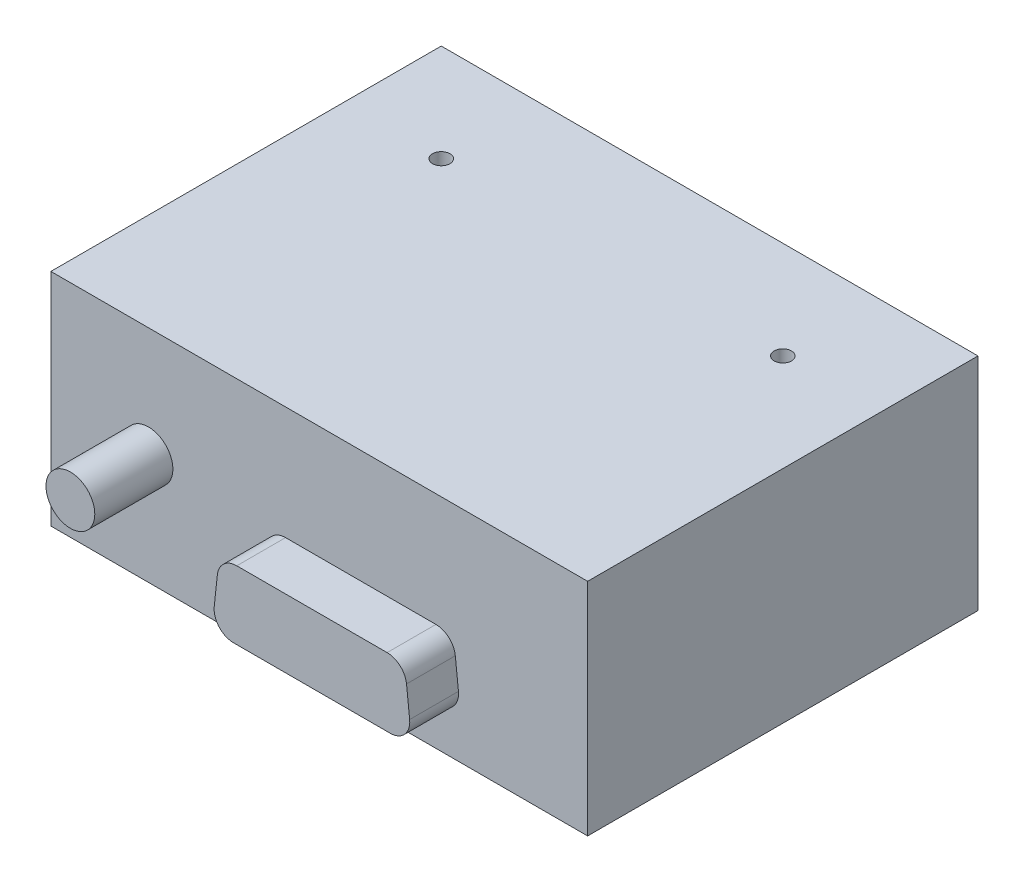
ISO-10303-21;
HEADER;
FILE_DESCRIPTION(('STEP AP214'),'2;1');
FILE_NAME('part.step','',(''),(''),'','','');
FILE_SCHEMA(('AUTOMOTIVE_DESIGN { 1 0 10303 214 1 1 1 1 }'));
ENDSEC;
DATA;
#1=APPLICATION_CONTEXT('core data for automotive mechanical design processes');
#2=APPLICATION_PROTOCOL_DEFINITION('international standard','automotive_design',2000,#1);
#3=PRODUCT_CONTEXT('',#1,'mechanical');
#4=PRODUCT('Part','Part','',(#3));
#5=PRODUCT_RELATED_PRODUCT_CATEGORY('part','',(#4));
#6=PRODUCT_DEFINITION_FORMATION('','',#4);
#7=PRODUCT_DEFINITION_CONTEXT('part definition',#1,'design');
#8=PRODUCT_DEFINITION('design','',#6,#7);
#9=PRODUCT_DEFINITION_SHAPE('','',#8);
#10=(LENGTH_UNIT() NAMED_UNIT(*) SI_UNIT(.MILLI.,.METRE.));
#11=(NAMED_UNIT(*) PLANE_ANGLE_UNIT() SI_UNIT($,.RADIAN.));
#12=(NAMED_UNIT(*) SI_UNIT($,.STERADIAN.) SOLID_ANGLE_UNIT());
#13=UNCERTAINTY_MEASURE_WITH_UNIT(LENGTH_MEASURE(1.E-05),#10,'distance_accuracy_value','');
#14=(GEOMETRIC_REPRESENTATION_CONTEXT(3) GLOBAL_UNCERTAINTY_ASSIGNED_CONTEXT((#13)) GLOBAL_UNIT_ASSIGNED_CONTEXT((#10,
#11,#12)) REPRESENTATION_CONTEXT('',''));
#15=CARTESIAN_POINT('',(0.,0.,0.));
#16=DIRECTION('',(0.,0.,1.));
#17=DIRECTION('',(1.,0.,0.));
#18=AXIS2_PLACEMENT_3D('',#15,#16,#17);
#19=CARTESIAN_POINT('',(0.,28.702,50.8));
#20=DIRECTION('',(0.,0.,-1.));
#21=DIRECTION('',(-1.00000000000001,0.,0.));
#22=AXIS2_PLACEMENT_3D('',#19,#20,#21);
#23=PLANE('',#22);
#24=DIRECTION('',(0.,-1.00000000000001,0.));
#25=VECTOR('',#24,1.);
#26=CARTESIAN_POINT('',(0.,0.,50.7999999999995));
#27=LINE('',#26,#25);
#28=CARTESIAN_POINT('',(0.,28.702,50.8));
#29=VERTEX_POINT('',#28);
#30=CARTESIAN_POINT('',(0.,0.,50.7999999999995));
#31=VERTEX_POINT('',#30);
#32=EDGE_CURVE('E220',#29,#31,#27,.T.);
#33=ORIENTED_EDGE('',*,*,#32,.T.);
#34=DIRECTION('',(1.00000000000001,0.,0.));
#35=VECTOR('',#34,1.);
#36=CARTESIAN_POINT('',(0.,0.,50.7999999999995));
#37=LINE('',#36,#35);
#38=CARTESIAN_POINT('',(69.8500000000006,0.,50.7999999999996));
#39=VERTEX_POINT('',#38);
#40=EDGE_CURVE('E85',#31,#39,#37,.T.);
#41=ORIENTED_EDGE('',*,*,#40,.T.);
#42=DIRECTION('',(0.,1.00000000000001,0.));
#43=VECTOR('',#42,1.);
#44=CARTESIAN_POINT('',(69.8500000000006,0.,50.7999999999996));
#45=LINE('',#44,#43);
#46=CARTESIAN_POINT('',(69.8500000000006,28.7020000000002,50.8));
#47=VERTEX_POINT('',#46);
#48=EDGE_CURVE('E223',#39,#47,#45,.T.);
#49=ORIENTED_EDGE('',*,*,#48,.T.);
#50=DIRECTION('',(-1.00000000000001,0.,0.));
#51=VECTOR('',#50,1.);
#52=CARTESIAN_POINT('',(0.,28.702,50.8));
#53=LINE('',#52,#51);
#54=EDGE_CURVE('E56',#47,#29,#53,.T.);
#55=ORIENTED_EDGE('',*,*,#54,.T.);
#56=EDGE_LOOP('',(#33,#41,#49,#55));
#57=FACE_BOUND('',#56,.T.);
#58=CARTESIAN_POINT('',(50.1051053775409,11.4300000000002,50.7999999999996));
#59=DIRECTION('',(0.,0.,1.));
#60=DIRECTION('',(1.00000000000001,0.,0.));
#61=AXIS2_PLACEMENT_3D('',#58,#59,#60);
#62=CIRCLE('',#61,2.54);
#63=CARTESIAN_POINT('',(52.6306506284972,11.7005941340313,50.7999999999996));
#64=VERTEX_POINT('',#63);
#65=CARTESIAN_POINT('',(50.1051053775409,13.9700000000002,50.7999999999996));
#66=VERTEX_POINT('',#65);
#67=EDGE_CURVE('E186',#64,#66,#62,.T.);
#68=ORIENTED_EDGE('',*,*,#67,.F.);
#69=DIRECTION('',(0.106533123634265,-0.994309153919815,0.));
#70=VECTOR('',#69,1.);
#71=CARTESIAN_POINT('',(58.3859190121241,-42.0152441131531,50.8));
#72=LINE('',#71,#70);
#73=CARTESIAN_POINT('',(53.0388649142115,7.89059413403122,50.7999999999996));
#74=VERTEX_POINT('',#73);
#75=EDGE_CURVE('E159',#64,#74,#72,.T.);
#76=ORIENTED_EDGE('',*,*,#75,.T.);
#77=CARTESIAN_POINT('',(50.5133196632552,7.62000000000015,50.7999999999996));
#78=DIRECTION('',(0.,0.,1.));
#79=DIRECTION('',(1.00000000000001,0.,0.));
#80=AXIS2_PLACEMENT_3D('',#77,#78,#79);
#81=CIRCLE('',#80,2.54);
#82=CARTESIAN_POINT('',(50.5133196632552,5.08000000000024,50.7999999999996));
#83=VERTEX_POINT('',#82);
#84=EDGE_CURVE('E164',#74,#83,#81,.F.);
#85=ORIENTED_EDGE('',*,*,#84,.T.);
#86=DIRECTION('',(-1.00000000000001,0.,0.));
#87=VECTOR('',#86,1.);
#88=CARTESIAN_POINT('',(34.9250000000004,5.08000000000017,50.7999999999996));
#89=LINE('',#88,#87);
#90=CARTESIAN_POINT('',(30.1316803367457,5.08000000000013,50.7999999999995));
#91=VERTEX_POINT('',#90);
#92=EDGE_CURVE('E47',#83,#91,#89,.T.);
#93=ORIENTED_EDGE('',*,*,#92,.T.);
#94=CARTESIAN_POINT('',(30.1316803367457,7.62000000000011,50.7999999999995));
#95=DIRECTION('',(0.,0.,1.));
#96=DIRECTION('',(1.00000000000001,0.,0.));
#97=AXIS2_PLACEMENT_3D('',#94,#95,#96);
#98=CIRCLE('',#97,2.54);
#99=CARTESIAN_POINT('',(27.6061350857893,7.89059413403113,50.8));
#100=VERTEX_POINT('',#99);
#101=EDGE_CURVE('E198',#91,#100,#98,.F.);
#102=ORIENTED_EDGE('',*,*,#101,.T.);
#103=DIRECTION('',(0.106533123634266,0.994309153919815,0.));
#104=VECTOR('',#103,1.);
#105=CARTESIAN_POINT('',(22.1365652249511,-43.1587245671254,50.8));
#106=LINE('',#105,#104);
#107=CARTESIAN_POINT('',(28.0143493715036,11.7005941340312,50.7999999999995));
#108=VERTEX_POINT('',#107);
#109=EDGE_CURVE('E195',#100,#108,#106,.T.);
#110=ORIENTED_EDGE('',*,*,#109,.T.);
#111=CARTESIAN_POINT('',(30.53989462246,11.4300000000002,50.7999999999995));
#112=DIRECTION('',(0.,0.,1.));
#113=DIRECTION('',(1.00000000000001,0.,0.));
#114=AXIS2_PLACEMENT_3D('',#111,#112,#113);
#115=CIRCLE('',#114,2.54);
#116=CARTESIAN_POINT('',(30.53989462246,13.9700000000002,50.7999999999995));
#117=VERTEX_POINT('',#116);
#118=EDGE_CURVE('E192',#117,#108,#115,.T.);
#119=ORIENTED_EDGE('',*,*,#118,.F.);
#120=DIRECTION('',(1.00000000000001,0.,0.));
#121=VECTOR('',#120,1.);
#122=CARTESIAN_POINT('',(34.9250000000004,13.9700000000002,50.7999999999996));
#123=LINE('',#122,#121);
#124=EDGE_CURVE('E189',#117,#66,#123,.T.);
#125=ORIENTED_EDGE('',*,*,#124,.T.);
#126=EDGE_LOOP('',(#68,#76,#85,#93,#102,#110,#119,#125));
#127=FACE_BOUND('',#126,.T.);
#128=CARTESIAN_POINT('',(12.7000000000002,14.3510000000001,50.7999999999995));
#129=DIRECTION('',(0.,0.,-1.));
#130=DIRECTION('',(-1.00000000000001,0.,0.));
#131=AXIS2_PLACEMENT_3D('',#128,#129,#130);
#132=CIRCLE('',#131,3.175);
#133=CARTESIAN_POINT('',(9.52500000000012,14.3510000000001,50.7999999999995));
#134=VERTEX_POINT('',#133);
#135=EDGE_CURVE('E11',#134,#134,#132,.F.);
#136=ORIENTED_EDGE('',*,*,#135,.F.);
#137=EDGE_LOOP('',(#136));
#138=FACE_BOUND('',#137,.T.);
#139=ADVANCED_FACE('F32',(#57,#127,#138),#23,.F.);
#140=CARTESIAN_POINT('',(0.,0.,50.7999999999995));
#141=DIRECTION('',(1.00000000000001,0.,0.));
#142=DIRECTION('',(0.,0.,-1.));
#143=AXIS2_PLACEMENT_3D('',#140,#141,#142);
#144=PLANE('',#143);
#145=DIRECTION('',(0.,-1.00000000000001,0.));
#146=VECTOR('',#145,1.);
#147=CARTESIAN_POINT('',(0.,0.,-4.44089209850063E-13));
#148=LINE('',#147,#146);
#149=CARTESIAN_POINT('',(0.,28.702,0.));
#150=VERTEX_POINT('',#149);
#151=CARTESIAN_POINT('',(0.,0.,-4.44089209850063E-13));
#152=VERTEX_POINT('',#151);
#153=EDGE_CURVE('E219',#150,#152,#148,.T.);
#154=ORIENTED_EDGE('',*,*,#153,.T.);
#155=DIRECTION('',(0.,0.,-1.));
#156=VECTOR('',#155,1.);
#157=CARTESIAN_POINT('',(0.,0.,50.7999999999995));
#158=LINE('',#157,#156);
#159=EDGE_CURVE('E40',#31,#152,#158,.T.);
#160=ORIENTED_EDGE('',*,*,#159,.F.);
#161=ORIENTED_EDGE('',*,*,#32,.F.);
#162=DIRECTION('',(0.,0.,-1.));
#163=VECTOR('',#162,1.);
#164=CARTESIAN_POINT('',(0.,28.702,50.8));
#165=LINE('',#164,#163);
#166=EDGE_CURVE('E226',#29,#150,#165,.T.);
#167=ORIENTED_EDGE('',*,*,#166,.T.);
#168=EDGE_LOOP('',(#154,#160,#161,#167));
#169=FACE_BOUND('',#168,.T.);
#170=ADVANCED_FACE('F34',(#169),#144,.F.);
#171=CARTESIAN_POINT('',(0.,0.,50.7999999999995));
#172=DIRECTION('',(0.,1.00000000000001,0.));
#173=DIRECTION('',(0.,0.,1.));
#174=AXIS2_PLACEMENT_3D('',#171,#172,#173);
#175=PLANE('',#174);
#176=DIRECTION('',(1.00000000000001,0.,0.));
#177=VECTOR('',#176,1.);
#178=CARTESIAN_POINT('',(0.,0.,-4.44089209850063E-13));
#179=LINE('',#178,#177);
#180=CARTESIAN_POINT('',(69.8500000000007,0.,-4.44089209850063E-13));
#181=VERTEX_POINT('',#180);
#182=EDGE_CURVE('E229',#152,#181,#179,.T.);
#183=ORIENTED_EDGE('',*,*,#182,.T.);
#184=DIRECTION('',(0.,0.,-1.));
#185=VECTOR('',#184,1.);
#186=CARTESIAN_POINT('',(69.8500000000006,0.,50.7999999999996));
#187=LINE('',#186,#185);
#188=EDGE_CURVE('E237',#39,#181,#187,.T.);
#189=ORIENTED_EDGE('',*,*,#188,.F.);
#190=ORIENTED_EDGE('',*,*,#40,.F.);
#191=ORIENTED_EDGE('',*,*,#159,.T.);
#192=EDGE_LOOP('',(#183,#189,#190,#191));
#193=FACE_BOUND('',#192,.T.);
#194=ADVANCED_FACE('F240',(#193),#175,.F.);
#195=CARTESIAN_POINT('',(69.8500000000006,0.,50.7999999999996));
#196=DIRECTION('',(-1.00000000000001,0.,0.));
#197=DIRECTION('',(0.,0.,1.));
#198=AXIS2_PLACEMENT_3D('',#195,#196,#197);
#199=PLANE('',#198);
#200=DIRECTION('',(0.,1.00000000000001,0.));
#201=VECTOR('',#200,1.);
#202=CARTESIAN_POINT('',(69.8500000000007,0.,-4.44089209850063E-13));
#203=LINE('',#202,#201);
#204=CARTESIAN_POINT('',(69.8500000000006,28.7020000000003,0.));
#205=VERTEX_POINT('',#204);
#206=EDGE_CURVE('E231',#181,#205,#203,.T.);
#207=ORIENTED_EDGE('',*,*,#206,.T.);
#208=DIRECTION('',(0.,0.,-1.));
#209=VECTOR('',#208,1.);
#210=CARTESIAN_POINT('',(69.8500000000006,28.7020000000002,50.8));
#211=LINE('',#210,#209);
#212=EDGE_CURVE('E235',#47,#205,#211,.T.);
#213=ORIENTED_EDGE('',*,*,#212,.F.);
#214=ORIENTED_EDGE('',*,*,#48,.F.);
#215=ORIENTED_EDGE('',*,*,#188,.T.);
#216=EDGE_LOOP('',(#207,#213,#214,#215));
#217=FACE_BOUND('',#216,.T.);
#218=ADVANCED_FACE('F249',(#217),#199,.F.);
#219=CARTESIAN_POINT('',(0.,28.702,50.8));
#220=DIRECTION('',(0.,-1.00000000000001,0.));
#221=DIRECTION('',(0.,0.,-1.));
#222=AXIS2_PLACEMENT_3D('',#219,#220,#221);
#223=PLANE('',#222);
#224=CARTESIAN_POINT('',(57.1500000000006,28.7020000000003,12.6999999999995));
#225=DIRECTION('',(0.,1.00000000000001,0.));
#226=DIRECTION('',(0.,0.,1.));
#227=AXIS2_PLACEMENT_3D('',#224,#225,#226);
#228=CIRCLE('',#227,1.13029999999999);
#229=CARTESIAN_POINT('',(57.1500000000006,28.7020000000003,13.8302999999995));
#230=VERTEX_POINT('',#229);
#231=EDGE_CURVE('E146',#230,#230,#228,.T.);
#232=ORIENTED_EDGE('',*,*,#231,.F.);
#233=EDGE_LOOP('',(#232));
#234=FACE_BOUND('',#233,.T.);
#235=CARTESIAN_POINT('',(12.7000000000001,28.7020000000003,12.7));
#236=DIRECTION('',(0.,1.00000000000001,0.));
#237=DIRECTION('',(0.,0.,1.));
#238=AXIS2_PLACEMENT_3D('',#235,#236,#237);
#239=CIRCLE('',#238,1.13029999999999);
#240=CARTESIAN_POINT('',(12.7000000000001,28.7020000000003,13.8303));
#241=VERTEX_POINT('',#240);
#242=EDGE_CURVE('E145',#241,#241,#239,.T.);
#243=ORIENTED_EDGE('',*,*,#242,.F.);
#244=EDGE_LOOP('',(#243));
#245=FACE_BOUND('',#244,.T.);
#246=DIRECTION('',(-1.00000000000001,0.,0.));
#247=VECTOR('',#246,1.);
#248=CARTESIAN_POINT('',(0.,28.702,0.));
#249=LINE('',#248,#247);
#250=EDGE_CURVE('E77',#205,#150,#249,.T.);
#251=ORIENTED_EDGE('',*,*,#250,.T.);
#252=ORIENTED_EDGE('',*,*,#166,.F.);
#253=ORIENTED_EDGE('',*,*,#54,.F.);
#254=ORIENTED_EDGE('',*,*,#212,.T.);
#255=EDGE_LOOP('',(#251,#252,#253,#254));
#256=FACE_BOUND('',#255,.T.);
#257=ADVANCED_FACE('F251',(#234,#245,#256),#223,.F.);
#258=CARTESIAN_POINT('',(0.,28.702,0.));
#259=DIRECTION('',(0.,0.,-1.));
#260=DIRECTION('',(-1.00000000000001,0.,0.));
#261=AXIS2_PLACEMENT_3D('',#258,#259,#260);
#262=PLANE('',#261);
#263=ORIENTED_EDGE('',*,*,#153,.F.);
#264=ORIENTED_EDGE('',*,*,#250,.F.);
#265=ORIENTED_EDGE('',*,*,#206,.F.);
#266=ORIENTED_EDGE('',*,*,#182,.F.);
#267=EDGE_LOOP('',(#263,#264,#265,#266));
#268=FACE_BOUND('',#267,.T.);
#269=ADVANCED_FACE('F245',(#268),#262,.T.);
#270=CARTESIAN_POINT('',(58.385919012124,-42.015244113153,57.15));
#271=DIRECTION('',(0.99430915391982,0.106533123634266,0.));
#272=DIRECTION('',(-0.106533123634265,0.994309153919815,0.));
#273=AXIS2_PLACEMENT_3D('',#270,#271,#272);
#274=PLANE('',#273);
#275=ORIENTED_EDGE('',*,*,#75,.F.);
#276=DIRECTION('',(0.,0.,-1.));
#277=VECTOR('',#276,1.);
#278=CARTESIAN_POINT('',(52.6306506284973,11.7005941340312,57.1499999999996));
#279=LINE('',#278,#277);
#280=CARTESIAN_POINT('',(52.6306506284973,11.7005941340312,57.1499999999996));
#281=VERTEX_POINT('',#280);
#282=EDGE_CURVE('E217',#281,#64,#279,.T.);
#283=ORIENTED_EDGE('',*,*,#282,.F.);
#284=DIRECTION('',(0.106533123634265,-0.994309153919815,0.));
#285=VECTOR('',#284,1.);
#286=CARTESIAN_POINT('',(58.385919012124,-42.015244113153,57.15));
#287=LINE('',#286,#285);
#288=CARTESIAN_POINT('',(53.0388649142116,7.8905941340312,57.1499999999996));
#289=VERTEX_POINT('',#288);
#290=EDGE_CURVE('E160',#281,#289,#287,.T.);
#291=ORIENTED_EDGE('',*,*,#290,.T.);
#292=DIRECTION('',(0.,0.,-1.));
#293=VECTOR('',#292,1.);
#294=CARTESIAN_POINT('',(53.0388649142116,7.8905941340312,57.1499999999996));
#295=LINE('',#294,#293);
#296=EDGE_CURVE('E183',#289,#74,#295,.T.);
#297=ORIENTED_EDGE('',*,*,#296,.T.);
#298=EDGE_LOOP('',(#275,#283,#291,#297));
#299=FACE_BOUND('',#298,.T.);
#300=ADVANCED_FACE('F303',(#299),#274,.T.);
#301=CARTESIAN_POINT('',(50.1051053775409,11.4300000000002,57.1499999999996));
#302=DIRECTION('',(0.,0.,-1.));
#303=DIRECTION('',(-1.00000000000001,0.,0.));
#304=AXIS2_PLACEMENT_3D('',#301,#302,#303);
#305=CYLINDRICAL_SURFACE('',#304,2.54);
#306=ORIENTED_EDGE('',*,*,#67,.T.);
#307=DIRECTION('',(0.,0.,-1.));
#308=VECTOR('',#307,1.);
#309=CARTESIAN_POINT('',(50.1051053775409,13.9700000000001,57.1499999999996));
#310=LINE('',#309,#308);
#311=CARTESIAN_POINT('',(50.1051053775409,13.9700000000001,57.1499999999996));
#312=VERTEX_POINT('',#311);
#313=EDGE_CURVE('E215',#312,#66,#310,.T.);
#314=ORIENTED_EDGE('',*,*,#313,.F.);
#315=CARTESIAN_POINT('',(50.1051053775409,11.4300000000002,57.1499999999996));
#316=DIRECTION('',(0.,0.,1.));
#317=DIRECTION('',(1.00000000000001,0.,0.));
#318=AXIS2_PLACEMENT_3D('',#315,#316,#317);
#319=CIRCLE('',#318,2.54);
#320=EDGE_CURVE('E163',#281,#312,#319,.T.);
#321=ORIENTED_EDGE('',*,*,#320,.F.);
#322=ORIENTED_EDGE('',*,*,#282,.T.);
#323=EDGE_LOOP('',(#306,#314,#321,#322));
#324=FACE_BOUND('',#323,.T.);
#325=ADVANCED_FACE('F299',(#324),#305,.T.);
#326=CARTESIAN_POINT('',(34.9250000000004,13.9700000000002,57.1499999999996));
#327=DIRECTION('',(0.,1.00000000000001,0.));
#328=DIRECTION('',(-1.00000000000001,0.,0.));
#329=AXIS2_PLACEMENT_3D('',#326,#327,#328);
#330=PLANE('',#329);
#331=ORIENTED_EDGE('',*,*,#124,.F.);
#332=DIRECTION('',(0.,0.,-1.));
#333=VECTOR('',#332,1.);
#334=CARTESIAN_POINT('',(30.53989462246,13.9700000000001,57.1499999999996));
#335=LINE('',#334,#333);
#336=CARTESIAN_POINT('',(30.53989462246,13.9700000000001,57.1499999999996));
#337=VERTEX_POINT('',#336);
#338=EDGE_CURVE('E213',#337,#117,#335,.T.);
#339=ORIENTED_EDGE('',*,*,#338,.F.);
#340=DIRECTION('',(1.00000000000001,0.,0.));
#341=VECTOR('',#340,1.);
#342=CARTESIAN_POINT('',(34.9250000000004,13.9700000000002,57.1499999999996));
#343=LINE('',#342,#341);
#344=EDGE_CURVE('E166',#337,#312,#343,.T.);
#345=ORIENTED_EDGE('',*,*,#344,.T.);
#346=ORIENTED_EDGE('',*,*,#313,.T.);
#347=EDGE_LOOP('',(#331,#339,#345,#346));
#348=FACE_BOUND('',#347,.T.);
#349=ADVANCED_FACE('F295',(#348),#330,.T.);
#350=CARTESIAN_POINT('',(30.53989462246,11.4300000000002,57.1499999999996));
#351=DIRECTION('',(0.,0.,-1.));
#352=DIRECTION('',(-1.00000000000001,0.,0.));
#353=AXIS2_PLACEMENT_3D('',#350,#351,#352);
#354=CYLINDRICAL_SURFACE('',#353,2.54);
#355=ORIENTED_EDGE('',*,*,#118,.T.);
#356=DIRECTION('',(0.,0.,-1.));
#357=VECTOR('',#356,1.);
#358=CARTESIAN_POINT('',(28.0143493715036,11.7005941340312,57.1499999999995));
#359=LINE('',#358,#357);
#360=CARTESIAN_POINT('',(28.0143493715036,11.7005941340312,57.1499999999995));
#361=VERTEX_POINT('',#360);
#362=EDGE_CURVE('E211',#361,#108,#359,.T.);
#363=ORIENTED_EDGE('',*,*,#362,.F.);
#364=CARTESIAN_POINT('',(30.53989462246,11.4300000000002,57.1499999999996));
#365=DIRECTION('',(0.,0.,1.));
#366=DIRECTION('',(1.00000000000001,0.,0.));
#367=AXIS2_PLACEMENT_3D('',#364,#365,#366);
#368=CIRCLE('',#367,2.54);
#369=EDGE_CURVE('E169',#337,#361,#368,.T.);
#370=ORIENTED_EDGE('',*,*,#369,.F.);
#371=ORIENTED_EDGE('',*,*,#338,.T.);
#372=EDGE_LOOP('',(#355,#363,#370,#371));
#373=FACE_BOUND('',#372,.T.);
#374=ADVANCED_FACE('F291',(#373),#354,.T.);
#375=CARTESIAN_POINT('',(22.1365652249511,-43.1587245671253,57.15));
#376=DIRECTION('',(-0.994309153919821,0.106533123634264,0.));
#377=DIRECTION('',(-0.106533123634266,-0.994309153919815,0.));
#378=AXIS2_PLACEMENT_3D('',#375,#376,#377);
#379=PLANE('',#378);
#380=ORIENTED_EDGE('',*,*,#109,.F.);
#381=DIRECTION('',(0.,0.,-1.));
#382=VECTOR('',#381,1.);
#383=CARTESIAN_POINT('',(27.6061350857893,7.89059413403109,57.15));
#384=LINE('',#383,#382);
#385=CARTESIAN_POINT('',(27.6061350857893,7.89059413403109,57.15));
#386=VERTEX_POINT('',#385);
#387=EDGE_CURVE('E209',#386,#100,#384,.T.);
#388=ORIENTED_EDGE('',*,*,#387,.F.);
#389=DIRECTION('',(0.106533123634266,0.994309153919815,0.));
#390=VECTOR('',#389,1.);
#391=CARTESIAN_POINT('',(22.1365652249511,-43.1587245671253,57.15));
#392=LINE('',#391,#390);
#393=EDGE_CURVE('E171',#386,#361,#392,.T.);
#394=ORIENTED_EDGE('',*,*,#393,.T.);
#395=ORIENTED_EDGE('',*,*,#362,.T.);
#396=EDGE_LOOP('',(#380,#388,#394,#395));
#397=FACE_BOUND('',#396,.T.);
#398=ADVANCED_FACE('F287',(#397),#379,.T.);
#399=CARTESIAN_POINT('',(30.1316803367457,7.62000000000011,57.1499999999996));
#400=DIRECTION('',(0.,0.,-1.));
#401=DIRECTION('',(-1.00000000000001,0.,0.));
#402=AXIS2_PLACEMENT_3D('',#399,#400,#401);
#403=CYLINDRICAL_SURFACE('',#402,2.54);
#404=ORIENTED_EDGE('',*,*,#101,.F.);
#405=DIRECTION('',(0.,0.,-1.));
#406=VECTOR('',#405,1.);
#407=CARTESIAN_POINT('',(30.1316803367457,5.08000000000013,57.1499999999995));
#408=LINE('',#407,#406);
#409=CARTESIAN_POINT('',(30.1316803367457,5.08000000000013,57.1499999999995));
#410=VERTEX_POINT('',#409);
#411=EDGE_CURVE('E207',#410,#91,#408,.T.);
#412=ORIENTED_EDGE('',*,*,#411,.F.);
#413=CARTESIAN_POINT('',(30.1316803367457,7.62000000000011,57.1499999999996));
#414=DIRECTION('',(0.,0.,1.));
#415=DIRECTION('',(1.00000000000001,0.,0.));
#416=AXIS2_PLACEMENT_3D('',#413,#414,#415);
#417=CIRCLE('',#416,2.54);
#418=EDGE_CURVE('E174',#410,#386,#417,.F.);
#419=ORIENTED_EDGE('',*,*,#418,.T.);
#420=ORIENTED_EDGE('',*,*,#387,.T.);
#421=EDGE_LOOP('',(#404,#412,#419,#420));
#422=FACE_BOUND('',#421,.T.);
#423=ADVANCED_FACE('F284',(#422),#403,.T.);
#424=CARTESIAN_POINT('',(34.9250000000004,5.08000000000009,57.1499999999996));
#425=DIRECTION('',(0.,-1.00000000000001,0.));
#426=DIRECTION('',(1.00000000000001,0.,0.));
#427=AXIS2_PLACEMENT_3D('',#424,#425,#426);
#428=PLANE('',#427);
#429=ORIENTED_EDGE('',*,*,#92,.F.);
#430=DIRECTION('',(0.,0.,-1.));
#431=VECTOR('',#430,1.);
#432=CARTESIAN_POINT('',(50.5133196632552,5.08000000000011,57.1499999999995));
#433=LINE('',#432,#431);
#434=CARTESIAN_POINT('',(50.5133196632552,5.08000000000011,57.1499999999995));
#435=VERTEX_POINT('',#434);
#436=EDGE_CURVE('E205',#435,#83,#433,.T.);
#437=ORIENTED_EDGE('',*,*,#436,.F.);
#438=DIRECTION('',(-1.00000000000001,0.,0.));
#439=VECTOR('',#438,1.);
#440=CARTESIAN_POINT('',(34.9250000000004,5.08000000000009,57.1499999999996));
#441=LINE('',#440,#439);
#442=EDGE_CURVE('E177',#435,#410,#441,.T.);
#443=ORIENTED_EDGE('',*,*,#442,.T.);
#444=ORIENTED_EDGE('',*,*,#411,.T.);
#445=EDGE_LOOP('',(#429,#437,#443,#444));
#446=FACE_BOUND('',#445,.T.);
#447=ADVANCED_FACE('F280',(#446),#428,.T.);
#448=CARTESIAN_POINT('',(50.5133196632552,7.6200000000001,57.1499999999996));
#449=DIRECTION('',(0.,0.,-1.));
#450=DIRECTION('',(-1.00000000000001,0.,0.));
#451=AXIS2_PLACEMENT_3D('',#448,#449,#450);
#452=CYLINDRICAL_SURFACE('',#451,2.54);
#453=ORIENTED_EDGE('',*,*,#84,.F.);
#454=ORIENTED_EDGE('',*,*,#296,.F.);
#455=CARTESIAN_POINT('',(50.5133196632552,7.6200000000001,57.1499999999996));
#456=DIRECTION('',(0.,0.,1.));
#457=DIRECTION('',(1.00000000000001,0.,0.));
#458=AXIS2_PLACEMENT_3D('',#455,#456,#457);
#459=CIRCLE('',#458,2.54);
#460=EDGE_CURVE('E180',#289,#435,#459,.F.);
#461=ORIENTED_EDGE('',*,*,#460,.T.);
#462=ORIENTED_EDGE('',*,*,#436,.T.);
#463=EDGE_LOOP('',(#453,#454,#461,#462));
#464=FACE_BOUND('',#463,.T.);
#465=ADVANCED_FACE('F272',(#464),#452,.T.);
#466=CARTESIAN_POINT('',(34.9250000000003,-44.5289140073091,57.15));
#467=DIRECTION('',(0.,0.,1.));
#468=DIRECTION('',(1.00000000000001,0.,0.));
#469=AXIS2_PLACEMENT_3D('',#466,#467,#468);
#470=PLANE('',#469);
#471=ORIENTED_EDGE('',*,*,#290,.F.);
#472=ORIENTED_EDGE('',*,*,#320,.T.);
#473=ORIENTED_EDGE('',*,*,#344,.F.);
#474=ORIENTED_EDGE('',*,*,#369,.T.);
#475=ORIENTED_EDGE('',*,*,#393,.F.);
#476=ORIENTED_EDGE('',*,*,#418,.F.);
#477=ORIENTED_EDGE('',*,*,#442,.F.);
#478=ORIENTED_EDGE('',*,*,#460,.F.);
#479=EDGE_LOOP('',(#471,#472,#473,#474,#475,#476,#477,#478));
#480=FACE_BOUND('',#479,.T.);
#481=ADVANCED_FACE('F262',(#480),#470,.T.);
#482=CARTESIAN_POINT('',(12.7000000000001,14.3510000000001,60.9599999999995));
#483=DIRECTION('',(0.,0.,-1.));
#484=DIRECTION('',(-1.00000000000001,0.,0.));
#485=AXIS2_PLACEMENT_3D('',#482,#483,#484);
#486=CYLINDRICAL_SURFACE('',#485,3.175);
#487=CARTESIAN_POINT('',(12.7000000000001,14.3510000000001,60.9599999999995));
#488=DIRECTION('',(0.,0.,1.));
#489=DIRECTION('',(1.00000000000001,0.,0.));
#490=AXIS2_PLACEMENT_3D('',#487,#488,#489);
#491=CIRCLE('',#490,3.175);
#492=CARTESIAN_POINT('',(15.8750000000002,14.3510000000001,60.9599999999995));
#493=VERTEX_POINT('',#492);
#494=EDGE_CURVE('E156',#493,#493,#491,.T.);
#495=ORIENTED_EDGE('',*,*,#494,.F.);
#496=EDGE_LOOP('',(#495));
#497=FACE_BOUND('',#496,.T.);
#498=ORIENTED_EDGE('',*,*,#135,.T.);
#499=EDGE_LOOP('',(#498));
#500=FACE_BOUND('',#499,.T.);
#501=ADVANCED_FACE('F259',(#497,#500),#486,.T.);
#502=CARTESIAN_POINT('',(34.9250000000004,-44.5289140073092,60.96));
#503=DIRECTION('',(0.,0.,1.));
#504=DIRECTION('',(1.00000000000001,0.,0.));
#505=AXIS2_PLACEMENT_3D('',#502,#503,#504);
#506=PLANE('',#505);
#507=ORIENTED_EDGE('',*,*,#494,.T.);
#508=EDGE_LOOP('',(#507));
#509=FACE_BOUND('',#508,.T.);
#510=ADVANCED_FACE('F261',(#509),#506,.T.);
#511=CARTESIAN_POINT('',(12.7000000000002,19.8120000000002,12.6999999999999));
#512=DIRECTION('',(0.,1.00000000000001,0.));
#513=DIRECTION('',(0.,0.,1.));
#514=AXIS2_PLACEMENT_3D('',#511,#512,#513);
#515=CONICAL_SURFACE('',#514,1.13029999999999,1.02974425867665);
#516=CARTESIAN_POINT('',(12.7000000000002,19.1328472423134,12.6999999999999));
#517=VERTEX_POINT('',#516);
#518=VERTEX_LOOP('',#517);
#519=FACE_BOUND('',#518,.T.);
#520=CARTESIAN_POINT('',(12.7000000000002,19.8120000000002,12.6999999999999));
#521=DIRECTION('',(0.,1.00000000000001,0.));
#522=DIRECTION('',(0.,0.,1.));
#523=AXIS2_PLACEMENT_3D('',#520,#521,#522);
#524=CIRCLE('',#523,1.13029999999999);
#525=CARTESIAN_POINT('',(12.7000000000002,19.8120000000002,13.8302999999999));
#526=VERTEX_POINT('',#525);
#527=EDGE_CURVE('E149',#526,#526,#524,.T.);
#528=ORIENTED_EDGE('',*,*,#527,.T.);
#529=EDGE_LOOP('',(#528));
#530=FACE_BOUND('',#529,.T.);
#531=ADVANCED_FACE('F269',(#519,#530),#515,.F.);
#532=CARTESIAN_POINT('',(12.7000000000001,28.7020000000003,12.7));
#533=DIRECTION('',(0.,1.00000000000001,0.));
#534=DIRECTION('',(0.,0.,1.));
#535=AXIS2_PLACEMENT_3D('',#532,#533,#534);
#536=CYLINDRICAL_SURFACE('',#535,1.13029999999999);
#537=ORIENTED_EDGE('',*,*,#527,.F.);
#538=EDGE_LOOP('',(#537));
#539=FACE_BOUND('',#538,.T.);
#540=ORIENTED_EDGE('',*,*,#242,.T.);
#541=EDGE_LOOP('',(#540));
#542=FACE_BOUND('',#541,.T.);
#543=ADVANCED_FACE('F139',(#539,#542),#536,.F.);
#544=CARTESIAN_POINT('',(57.1500000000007,19.8120000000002,12.7));
#545=DIRECTION('',(0.,1.00000000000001,0.));
#546=DIRECTION('',(0.,0.,1.));
#547=AXIS2_PLACEMENT_3D('',#544,#545,#546);
#548=CONICAL_SURFACE('',#547,1.13029999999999,1.02974425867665);
#549=CARTESIAN_POINT('',(57.1500000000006,19.1328472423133,12.7));
#550=VERTEX_POINT('',#549);
#551=VERTEX_LOOP('',#550);
#552=FACE_BOUND('',#551,.T.);
#553=CARTESIAN_POINT('',(57.1500000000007,19.8120000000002,12.7));
#554=DIRECTION('',(0.,1.00000000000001,0.));
#555=DIRECTION('',(0.,0.,1.));
#556=AXIS2_PLACEMENT_3D('',#553,#554,#555);
#557=CIRCLE('',#556,1.13029999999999);
#558=CARTESIAN_POINT('',(57.1500000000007,19.8120000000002,13.8303));
#559=VERTEX_POINT('',#558);
#560=EDGE_CURVE('E143',#559,#559,#557,.T.);
#561=ORIENTED_EDGE('',*,*,#560,.T.);
#562=EDGE_LOOP('',(#561));
#563=FACE_BOUND('',#562,.T.);
#564=ADVANCED_FACE('F135',(#552,#563),#548,.F.);
#565=CARTESIAN_POINT('',(57.1500000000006,28.7020000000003,12.6999999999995));
#566=DIRECTION('',(0.,1.00000000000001,0.));
#567=DIRECTION('',(0.,0.,1.));
#568=AXIS2_PLACEMENT_3D('',#565,#566,#567);
#569=CYLINDRICAL_SURFACE('',#568,1.13029999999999);
#570=ORIENTED_EDGE('',*,*,#560,.F.);
#571=EDGE_LOOP('',(#570));
#572=FACE_BOUND('',#571,.T.);
#573=ORIENTED_EDGE('',*,*,#231,.T.);
#574=EDGE_LOOP('',(#573));
#575=FACE_BOUND('',#574,.T.);
#576=ADVANCED_FACE('F138',(#572,#575),#569,.F.);
#577=CLOSED_SHELL('',(#139,#170,#194,#218,#257,#269,#300,#325,#349,#374,#398,#423,#447,#465,
#481,#501,#510,#531,#543,#564,#576));
#578=MANIFOLD_SOLID_BREP('B2',#577);
#579=ADVANCED_BREP_SHAPE_REPRESENTATION('',(#18,#578),#14);
#580=SHAPE_DEFINITION_REPRESENTATION(#9,#579);
ENDSEC;
END-ISO-10303-21;
